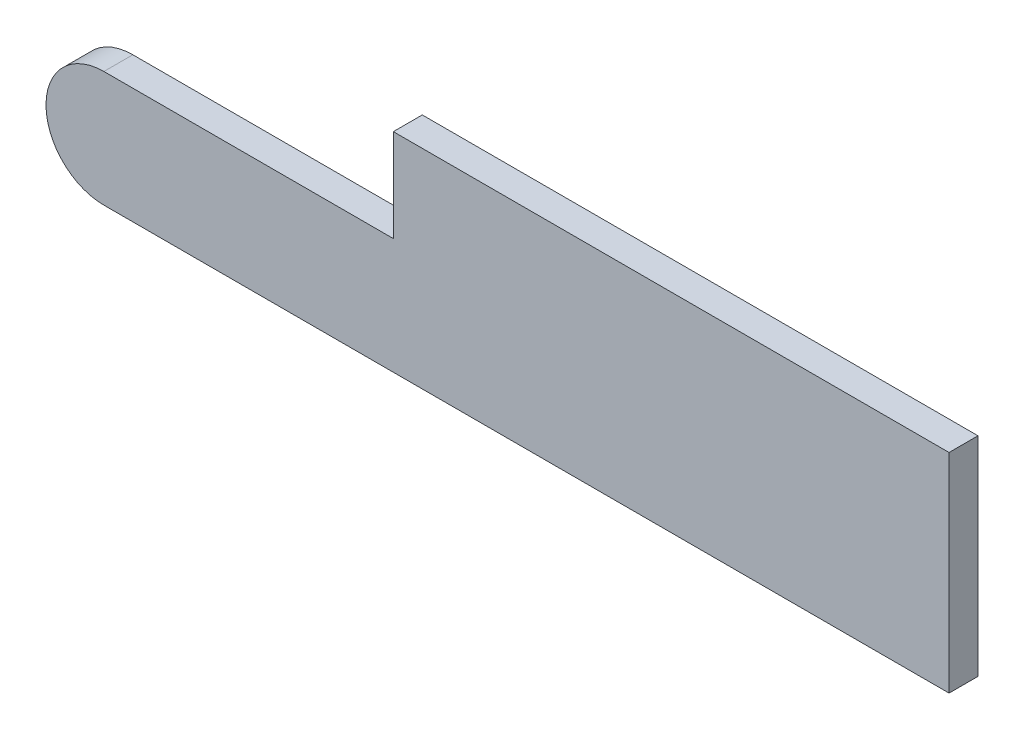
ISO-10303-21;
HEADER;
FILE_DESCRIPTION(('STEP AP214'),'2;1');
FILE_NAME('part.step','',(''),(''),'','','');
FILE_SCHEMA(('AUTOMOTIVE_DESIGN { 1 0 10303 214 1 1 1 1 }'));
ENDSEC;
DATA;
#1=APPLICATION_CONTEXT('core data for automotive mechanical design processes');
#2=APPLICATION_PROTOCOL_DEFINITION('international standard','automotive_design',2000,#1);
#3=PRODUCT_CONTEXT('',#1,'mechanical');
#4=PRODUCT('Part','Part','',(#3));
#5=PRODUCT_RELATED_PRODUCT_CATEGORY('part','',(#4));
#6=PRODUCT_DEFINITION_FORMATION('','',#4);
#7=PRODUCT_DEFINITION_CONTEXT('part definition',#1,'design');
#8=PRODUCT_DEFINITION('design','',#6,#7);
#9=PRODUCT_DEFINITION_SHAPE('','',#8);
#10=(LENGTH_UNIT() NAMED_UNIT(*) SI_UNIT(.MILLI.,.METRE.));
#11=(NAMED_UNIT(*) PLANE_ANGLE_UNIT() SI_UNIT($,.RADIAN.));
#12=(NAMED_UNIT(*) SI_UNIT($,.STERADIAN.) SOLID_ANGLE_UNIT());
#13=UNCERTAINTY_MEASURE_WITH_UNIT(LENGTH_MEASURE(1.E-05),#10,'distance_accuracy_value','');
#14=(GEOMETRIC_REPRESENTATION_CONTEXT(3) GLOBAL_UNCERTAINTY_ASSIGNED_CONTEXT((#13)) GLOBAL_UNIT_ASSIGNED_CONTEXT((#10,
#11,#12)) REPRESENTATION_CONTEXT('',''));
#15=CARTESIAN_POINT('',(0.,0.,0.));
#16=DIRECTION('',(0.,0.,1.));
#17=DIRECTION('',(1.,0.,0.));
#18=AXIS2_PLACEMENT_3D('',#15,#16,#17);
#19=CARTESIAN_POINT('',(0.,0.,-0.25));
#20=DIRECTION('',(0.,-1.,0.));
#21=DIRECTION('',(0.,0.,-1.));
#22=AXIS2_PLACEMENT_3D('',#19,#20,#21);
#23=PLANE('',#22);
#24=DIRECTION('',(1.,0.,0.));
#25=VECTOR('',#24,1.);
#26=CARTESIAN_POINT('',(0.,0.,0.));
#27=LINE('',#26,#25);
#28=CARTESIAN_POINT('',(-2.5,0.,0.));
#29=VERTEX_POINT('',#28);
#30=CARTESIAN_POINT('',(4.8,0.,0.));
#31=VERTEX_POINT('',#30);
#32=EDGE_CURVE('E111',#29,#31,#27,.T.);
#33=ORIENTED_EDGE('',*,*,#32,.F.);
#34=DIRECTION('',(0.,0.,1.));
#35=VECTOR('',#34,1.);
#36=CARTESIAN_POINT('',(-2.5,0.,-0.25));
#37=LINE('',#36,#35);
#38=CARTESIAN_POINT('',(-2.5,0.,-0.25));
#39=VERTEX_POINT('',#38);
#40=EDGE_CURVE('E107',#29,#39,#37,.F.);
#41=ORIENTED_EDGE('',*,*,#40,.T.);
#42=DIRECTION('',(1.,0.,0.));
#43=VECTOR('',#42,1.);
#44=CARTESIAN_POINT('',(0.,0.,-0.25));
#45=LINE('',#44,#43);
#46=CARTESIAN_POINT('',(4.8,0.,-0.25));
#47=VERTEX_POINT('',#46);
#48=EDGE_CURVE('E101',#39,#47,#45,.T.);
#49=ORIENTED_EDGE('',*,*,#48,.T.);
#50=DIRECTION('',(0.,0.,1.));
#51=VECTOR('',#50,1.);
#52=CARTESIAN_POINT('',(4.8,0.,-0.25));
#53=LINE('',#52,#51);
#54=EDGE_CURVE('E104',#47,#31,#53,.T.);
#55=ORIENTED_EDGE('',*,*,#54,.T.);
#56=EDGE_LOOP('',(#33,#41,#49,#55));
#57=FACE_BOUND('',#56,.T.);
#58=ADVANCED_FACE('F43',(#57),#23,.T.);
#59=CARTESIAN_POINT('',(-3.,0.999999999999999,-0.25));
#60=DIRECTION('',(0.,1.,0.));
#61=DIRECTION('',(0.,0.,1.));
#62=AXIS2_PLACEMENT_3D('',#59,#60,#61);
#63=PLANE('',#62);
#64=DIRECTION('',(-1.,0.,0.));
#65=VECTOR('',#64,1.);
#66=CARTESIAN_POINT('',(-3.,0.999999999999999,-0.25));
#67=LINE('',#66,#65);
#68=CARTESIAN_POINT('',(0.,0.999999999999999,-0.25));
#69=VERTEX_POINT('',#68);
#70=CARTESIAN_POINT('',(-2.5,0.999999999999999,-0.25));
#71=VERTEX_POINT('',#70);
#72=EDGE_CURVE('E120',#69,#71,#67,.T.);
#73=ORIENTED_EDGE('',*,*,#72,.T.);
#74=DIRECTION('',(0.,0.,1.));
#75=VECTOR('',#74,1.);
#76=CARTESIAN_POINT('',(-2.5,0.999999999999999,-0.25));
#77=LINE('',#76,#75);
#78=CARTESIAN_POINT('',(-2.5,0.999999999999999,0.));
#79=VERTEX_POINT('',#78);
#80=EDGE_CURVE('E11',#71,#79,#77,.T.);
#81=ORIENTED_EDGE('',*,*,#80,.T.);
#82=DIRECTION('',(-1.,0.,0.));
#83=VECTOR('',#82,1.);
#84=CARTESIAN_POINT('',(-3.,0.999999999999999,0.));
#85=LINE('',#84,#83);
#86=CARTESIAN_POINT('',(0.,0.999999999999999,0.));
#87=VERTEX_POINT('',#86);
#88=EDGE_CURVE('E148',#87,#79,#85,.T.);
#89=ORIENTED_EDGE('',*,*,#88,.F.);
#90=DIRECTION('',(0.,0.,1.));
#91=VECTOR('',#90,1.);
#92=CARTESIAN_POINT('',(0.,0.999999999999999,-0.25));
#93=LINE('',#92,#91);
#94=EDGE_CURVE('E154',#69,#87,#93,.T.);
#95=ORIENTED_EDGE('',*,*,#94,.F.);
#96=EDGE_LOOP('',(#73,#81,#89,#95));
#97=FACE_BOUND('',#96,.T.);
#98=ADVANCED_FACE('F186',(#97),#63,.T.);
#99=CARTESIAN_POINT('',(0.,0.999999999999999,-0.25));
#100=DIRECTION('',(-1.,0.,0.));
#101=DIRECTION('',(0.,0.,1.));
#102=AXIS2_PLACEMENT_3D('',#99,#100,#101);
#103=PLANE('',#102);
#104=DIRECTION('',(0.,-1.,0.));
#105=VECTOR('',#104,1.);
#106=CARTESIAN_POINT('',(0.,0.999999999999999,0.));
#107=LINE('',#106,#105);
#108=CARTESIAN_POINT('',(0.,1.8,0.));
#109=VERTEX_POINT('',#108);
#110=EDGE_CURVE('E144',#109,#87,#107,.T.);
#111=ORIENTED_EDGE('',*,*,#110,.F.);
#112=DIRECTION('',(0.,0.,1.));
#113=VECTOR('',#112,1.);
#114=CARTESIAN_POINT('',(0.,1.8,-0.25));
#115=LINE('',#114,#113);
#116=CARTESIAN_POINT('',(0.,1.8,-0.25));
#117=VERTEX_POINT('',#116);
#118=EDGE_CURVE('E158',#117,#109,#115,.T.);
#119=ORIENTED_EDGE('',*,*,#118,.F.);
#120=DIRECTION('',(0.,-1.,0.));
#121=VECTOR('',#120,1.);
#122=CARTESIAN_POINT('',(0.,0.999999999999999,-0.25));
#123=LINE('',#122,#121);
#124=EDGE_CURVE('E130',#117,#69,#123,.T.);
#125=ORIENTED_EDGE('',*,*,#124,.T.);
#126=ORIENTED_EDGE('',*,*,#94,.T.);
#127=EDGE_LOOP('',(#111,#119,#125,#126));
#128=FACE_BOUND('',#127,.T.);
#129=ADVANCED_FACE('F190',(#128),#103,.T.);
#130=CARTESIAN_POINT('',(0.,1.8,-0.25));
#131=DIRECTION('',(0.,1.,0.));
#132=DIRECTION('',(-1.,0.,0.));
#133=AXIS2_PLACEMENT_3D('',#130,#131,#132);
#134=PLANE('',#133);
#135=DIRECTION('',(-1.,0.,0.));
#136=VECTOR('',#135,1.);
#137=CARTESIAN_POINT('',(0.,1.8,0.));
#138=LINE('',#137,#136);
#139=CARTESIAN_POINT('',(4.8,1.8,0.));
#140=VERTEX_POINT('',#139);
#141=EDGE_CURVE('E140',#140,#109,#138,.T.);
#142=ORIENTED_EDGE('',*,*,#141,.F.);
#143=DIRECTION('',(0.,0.,1.));
#144=VECTOR('',#143,1.);
#145=CARTESIAN_POINT('',(4.8,1.8,-0.25));
#146=LINE('',#145,#144);
#147=CARTESIAN_POINT('',(4.8,1.8,-0.25));
#148=VERTEX_POINT('',#147);
#149=EDGE_CURVE('E119',#148,#140,#146,.T.);
#150=ORIENTED_EDGE('',*,*,#149,.F.);
#151=DIRECTION('',(-1.,0.,0.));
#152=VECTOR('',#151,1.);
#153=CARTESIAN_POINT('',(0.,1.8,-0.25));
#154=LINE('',#153,#152);
#155=EDGE_CURVE('E126',#148,#117,#154,.T.);
#156=ORIENTED_EDGE('',*,*,#155,.T.);
#157=ORIENTED_EDGE('',*,*,#118,.T.);
#158=EDGE_LOOP('',(#142,#150,#156,#157));
#159=FACE_BOUND('',#158,.T.);
#160=ADVANCED_FACE('F192',(#159),#134,.T.);
#161=CARTESIAN_POINT('',(4.8,0.,-0.25));
#162=DIRECTION('',(1.,0.,0.));
#163=DIRECTION('',(0.,0.,-1.));
#164=AXIS2_PLACEMENT_3D('',#161,#162,#163);
#165=PLANE('',#164);
#166=DIRECTION('',(0.,1.,0.));
#167=VECTOR('',#166,1.);
#168=CARTESIAN_POINT('',(4.8,0.,0.));
#169=LINE('',#168,#167);
#170=EDGE_CURVE('E117',#31,#140,#169,.T.);
#171=ORIENTED_EDGE('',*,*,#170,.F.);
#172=ORIENTED_EDGE('',*,*,#54,.F.);
#173=DIRECTION('',(0.,1.,0.));
#174=VECTOR('',#173,1.);
#175=CARTESIAN_POINT('',(4.8,0.,-0.25));
#176=LINE('',#175,#174);
#177=EDGE_CURVE('E110',#47,#148,#176,.T.);
#178=ORIENTED_EDGE('',*,*,#177,.T.);
#179=ORIENTED_EDGE('',*,*,#149,.T.);
#180=EDGE_LOOP('',(#171,#172,#178,#179));
#181=FACE_BOUND('',#180,.T.);
#182=ADVANCED_FACE('F115',(#181),#165,.T.);
#183=CARTESIAN_POINT('',(0.,0.,-0.25));
#184=DIRECTION('',(0.,0.,1.));
#185=DIRECTION('',(1.,0.,0.));
#186=AXIS2_PLACEMENT_3D('',#183,#184,#185);
#187=PLANE('',#186);
#188=ORIENTED_EDGE('',*,*,#48,.F.);
#189=CARTESIAN_POINT('',(-2.5,0.5,-0.25));
#190=DIRECTION('',(0.,0.,1.));
#191=DIRECTION('',(1.,0.,0.));
#192=AXIS2_PLACEMENT_3D('',#189,#190,#191);
#193=CIRCLE('',#192,0.5);
#194=CARTESIAN_POINT('',(-3.,0.499999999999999,-0.25));
#195=VERTEX_POINT('',#194);
#196=EDGE_CURVE('E53',#39,#195,#193,.F.);
#197=ORIENTED_EDGE('',*,*,#196,.T.);
#198=CARTESIAN_POINT('',(-2.5,0.499999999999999,-0.25));
#199=DIRECTION('',(0.,0.,1.));
#200=DIRECTION('',(1.,0.,0.));
#201=AXIS2_PLACEMENT_3D('',#198,#199,#200);
#202=CIRCLE('',#201,0.5);
#203=EDGE_CURVE('E60',#195,#71,#202,.F.);
#204=ORIENTED_EDGE('',*,*,#203,.T.);
#205=ORIENTED_EDGE('',*,*,#72,.F.);
#206=ORIENTED_EDGE('',*,*,#124,.F.);
#207=ORIENTED_EDGE('',*,*,#155,.F.);
#208=ORIENTED_EDGE('',*,*,#177,.F.);
#209=EDGE_LOOP('',(#188,#197,#204,#205,#206,#207,#208));
#210=FACE_BOUND('',#209,.T.);
#211=ADVANCED_FACE('F123',(#210),#187,.F.);
#212=CARTESIAN_POINT('',(0.,0.,0.));
#213=DIRECTION('',(0.,0.,1.));
#214=DIRECTION('',(1.,0.,0.));
#215=AXIS2_PLACEMENT_3D('',#212,#213,#214);
#216=PLANE('',#215);
#217=CARTESIAN_POINT('',(-2.5,0.499999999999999,0.));
#218=DIRECTION('',(0.,0.,1.));
#219=DIRECTION('',(1.,0.,0.));
#220=AXIS2_PLACEMENT_3D('',#217,#218,#219);
#221=CIRCLE('',#220,0.5);
#222=CARTESIAN_POINT('',(-3.,0.499999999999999,0.));
#223=VERTEX_POINT('',#222);
#224=EDGE_CURVE('E157',#79,#223,#221,.T.);
#225=ORIENTED_EDGE('',*,*,#224,.T.);
#226=CARTESIAN_POINT('',(-2.5,0.5,0.));
#227=DIRECTION('',(0.,0.,1.));
#228=DIRECTION('',(1.,0.,0.));
#229=AXIS2_PLACEMENT_3D('',#226,#227,#228);
#230=CIRCLE('',#229,0.5);
#231=EDGE_CURVE('E165',#223,#29,#230,.T.);
#232=ORIENTED_EDGE('',*,*,#231,.T.);
#233=ORIENTED_EDGE('',*,*,#32,.T.);
#234=ORIENTED_EDGE('',*,*,#170,.T.);
#235=ORIENTED_EDGE('',*,*,#141,.T.);
#236=ORIENTED_EDGE('',*,*,#110,.T.);
#237=ORIENTED_EDGE('',*,*,#88,.T.);
#238=EDGE_LOOP('',(#225,#232,#233,#234,#235,#236,#237));
#239=FACE_BOUND('',#238,.T.);
#240=ADVANCED_FACE('F175',(#239),#216,.T.);
#241=CARTESIAN_POINT('',(-2.5,0.499999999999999,-0.25));
#242=DIRECTION('',(0.,0.,1.));
#243=DIRECTION('',(1.,0.,0.));
#244=AXIS2_PLACEMENT_3D('',#241,#242,#243);
#245=CYLINDRICAL_SURFACE('',#244,0.5);
#246=ORIENTED_EDGE('',*,*,#80,.F.);
#247=ORIENTED_EDGE('',*,*,#203,.F.);
#248=DIRECTION('',(0.,0.,1.));
#249=VECTOR('',#248,1.);
#250=CARTESIAN_POINT('',(-3.,0.499999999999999,-0.25));
#251=LINE('',#250,#249);
#252=EDGE_CURVE('E47',#223,#195,#251,.F.);
#253=ORIENTED_EDGE('',*,*,#252,.F.);
#254=ORIENTED_EDGE('',*,*,#224,.F.);
#255=EDGE_LOOP('',(#246,#247,#253,#254));
#256=FACE_BOUND('',#255,.T.);
#257=ADVANCED_FACE('F45',(#256),#245,.T.);
#258=CARTESIAN_POINT('',(-2.5,0.5,-0.25));
#259=DIRECTION('',(0.,0.,1.));
#260=DIRECTION('',(1.,0.,0.));
#261=AXIS2_PLACEMENT_3D('',#258,#259,#260);
#262=CYLINDRICAL_SURFACE('',#261,0.5);
#263=ORIENTED_EDGE('',*,*,#196,.F.);
#264=ORIENTED_EDGE('',*,*,#40,.F.);
#265=ORIENTED_EDGE('',*,*,#231,.F.);
#266=ORIENTED_EDGE('',*,*,#252,.T.);
#267=EDGE_LOOP('',(#263,#264,#265,#266));
#268=FACE_BOUND('',#267,.T.);
#269=ADVANCED_FACE('F180',(#268),#262,.T.);
#270=CLOSED_SHELL('',(#58,#98,#129,#160,#182,#211,#240,#257,#269));
#271=MANIFOLD_SOLID_BREP('B2',#270);
#272=ADVANCED_BREP_SHAPE_REPRESENTATION('',(#18,#271),#14);
#273=SHAPE_DEFINITION_REPRESENTATION(#9,#272);
ENDSEC;
END-ISO-10303-21;
